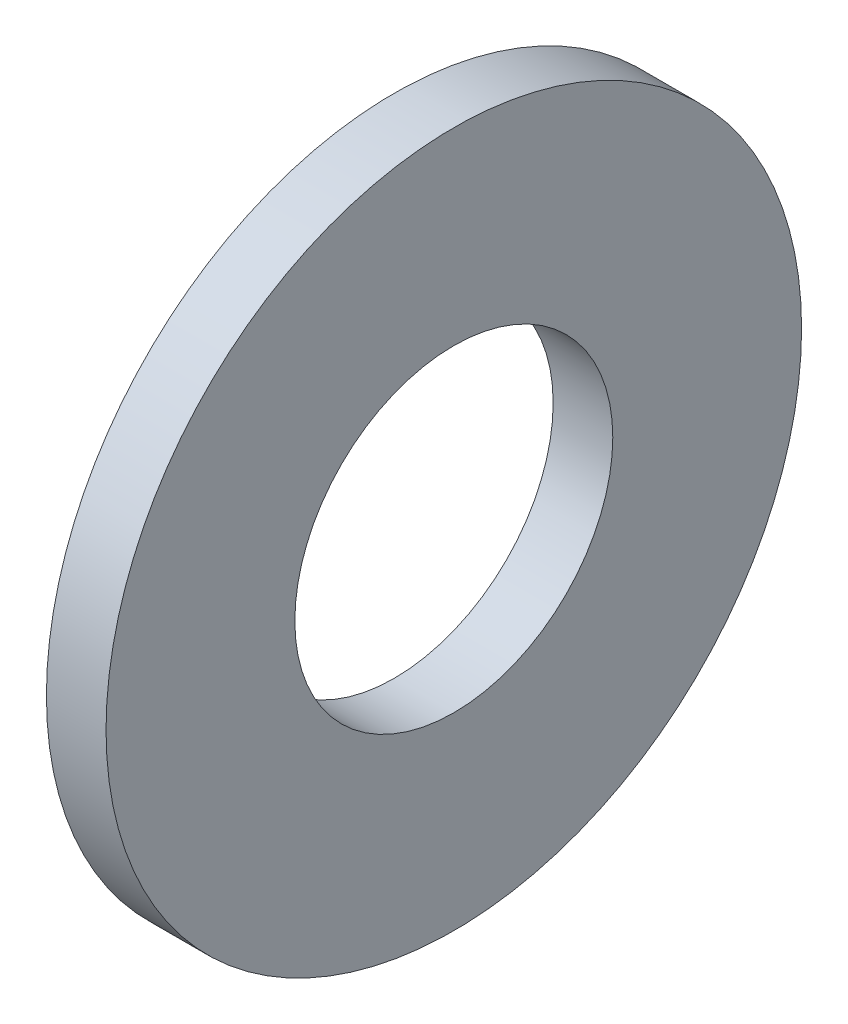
from build123d import *

# Parameters (mm, degrees)
ESQUISSE1_W = 1.2
ESQUISSE1_H = 3.8


with BuildPart() as part:
    # Esquisse1 → Base-R_volution (revolve)
    with BuildSketch(Plane(origin=(0, 0, 0), x_dir=(1, 0, 0), z_dir=(0, 1, 0)), mode=Mode.PRIVATE) as base_r_volution_sk:
        with Locations((0.6, 5.1)):
            Rectangle(ESQUISSE1_W, ESQUISSE1_H)
    revolve(base_r_volution_sk.sketch.rotate(Axis((0, 0, 0), (1, 0, 0)), 180), axis=Axis((0, 0, 0), (1, 0, 0)))


solid = part.part
